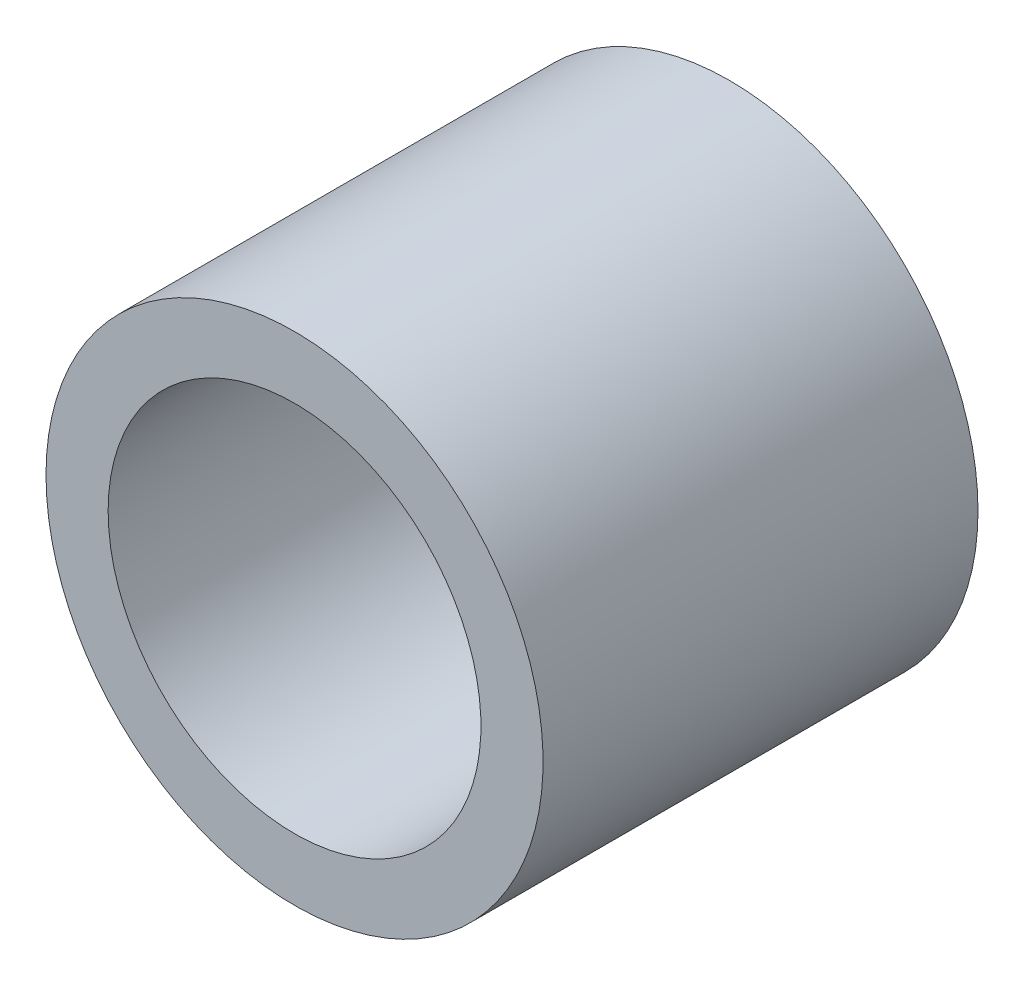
ISO-10303-21;
HEADER;
FILE_DESCRIPTION(('STEP AP214'),'2;1');
FILE_NAME('part.step','',(''),(''),'','','');
FILE_SCHEMA(('AUTOMOTIVE_DESIGN { 1 0 10303 214 1 1 1 1 }'));
ENDSEC;
DATA;
#1=APPLICATION_CONTEXT('core data for automotive mechanical design processes');
#2=APPLICATION_PROTOCOL_DEFINITION('international standard','automotive_design',2000,#1);
#3=PRODUCT_CONTEXT('',#1,'mechanical');
#4=PRODUCT('Part','Part','',(#3));
#5=PRODUCT_RELATED_PRODUCT_CATEGORY('part','',(#4));
#6=PRODUCT_DEFINITION_FORMATION('','',#4);
#7=PRODUCT_DEFINITION_CONTEXT('part definition',#1,'design');
#8=PRODUCT_DEFINITION('design','',#6,#7);
#9=PRODUCT_DEFINITION_SHAPE('','',#8);
#10=(LENGTH_UNIT() NAMED_UNIT(*) SI_UNIT(.MILLI.,.METRE.));
#11=(NAMED_UNIT(*) PLANE_ANGLE_UNIT() SI_UNIT($,.RADIAN.));
#12=(NAMED_UNIT(*) SI_UNIT($,.STERADIAN.) SOLID_ANGLE_UNIT());
#13=UNCERTAINTY_MEASURE_WITH_UNIT(LENGTH_MEASURE(1.E-05),#10,'distance_accuracy_value','');
#14=(GEOMETRIC_REPRESENTATION_CONTEXT(3) GLOBAL_UNCERTAINTY_ASSIGNED_CONTEXT((#13)) GLOBAL_UNIT_ASSIGNED_CONTEXT((#10,
#11,#12)) REPRESENTATION_CONTEXT('',''));
#15=CARTESIAN_POINT('',(0.,0.,0.));
#16=DIRECTION('',(0.,0.,1.));
#17=DIRECTION('',(1.,0.,0.));
#18=AXIS2_PLACEMENT_3D('',#15,#16,#17);
#19=CARTESIAN_POINT('',(-14.1568849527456,25.,0.));
#20=DIRECTION('',(0.,0.,1.));
#21=DIRECTION('',(1.,0.,0.));
#22=AXIS2_PLACEMENT_3D('',#19,#20,#21);
#23=PLANE('',#22);
#24=CARTESIAN_POINT('',(-14.1568849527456,25.,0.));
#25=DIRECTION('',(0.,0.,1.));
#26=DIRECTION('',(1.,0.,0.));
#27=AXIS2_PLACEMENT_3D('',#24,#25,#26);
#28=CIRCLE('',#27,4.);
#29=CARTESIAN_POINT('',(-10.1568849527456,25.,0.));
#30=VERTEX_POINT('',#29);
#31=EDGE_CURVE('E36',#30,#30,#28,.T.);
#32=ORIENTED_EDGE('',*,*,#31,.F.);
#33=EDGE_LOOP('',(#32));
#34=FACE_BOUND('',#33,.T.);
#35=CARTESIAN_POINT('',(-14.1568849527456,25.,0.));
#36=DIRECTION('',(0.,0.,1.));
#37=DIRECTION('',(1.,0.,0.));
#38=AXIS2_PLACEMENT_3D('',#35,#36,#37);
#39=CIRCLE('',#38,3.00000000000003);
#40=CARTESIAN_POINT('',(-11.1568849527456,25.,0.));
#41=VERTEX_POINT('',#40);
#42=EDGE_CURVE('E45',#41,#41,#39,.T.);
#43=ORIENTED_EDGE('',*,*,#42,.T.);
#44=EDGE_LOOP('',(#43));
#45=FACE_BOUND('',#44,.T.);
#46=ADVANCED_FACE('F29',(#34,#45),#23,.F.);
#47=CARTESIAN_POINT('',(-14.1568849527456,25.,18.3137084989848));
#48=DIRECTION('',(0.,0.,-1.));
#49=DIRECTION('',(-1.,0.,0.));
#50=AXIS2_PLACEMENT_3D('',#47,#48,#49);
#51=CYLINDRICAL_SURFACE('',#50,4.);
#52=CARTESIAN_POINT('',(-14.1568849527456,25.,7.));
#53=DIRECTION('',(0.,0.,-1.));
#54=DIRECTION('',(-1.,0.,0.));
#55=AXIS2_PLACEMENT_3D('',#52,#53,#54);
#56=CIRCLE('',#55,4.);
#57=CARTESIAN_POINT('',(-18.1568849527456,25.,7.));
#58=VERTEX_POINT('',#57);
#59=EDGE_CURVE('E40',#58,#58,#56,.T.);
#60=ORIENTED_EDGE('',*,*,#59,.T.);
#61=EDGE_LOOP('',(#60));
#62=FACE_BOUND('',#61,.T.);
#63=ORIENTED_EDGE('',*,*,#31,.T.);
#64=EDGE_LOOP('',(#63));
#65=FACE_BOUND('',#64,.T.);
#66=ADVANCED_FACE('F53',(#62,#65),#51,.T.);
#67=CARTESIAN_POINT('',(-14.1568849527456,25.,18.3137084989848));
#68=DIRECTION('',(0.,0.,-1.));
#69=DIRECTION('',(-1.,0.,0.));
#70=AXIS2_PLACEMENT_3D('',#67,#68,#69);
#71=CYLINDRICAL_SURFACE('',#70,3.00000000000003);
#72=CARTESIAN_POINT('',(-14.1568849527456,25.,7.));
#73=DIRECTION('',(0.,0.,-1.));
#74=DIRECTION('',(-1.,0.,0.));
#75=AXIS2_PLACEMENT_3D('',#72,#73,#74);
#76=CIRCLE('',#75,3.00000000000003);
#77=CARTESIAN_POINT('',(-17.1568849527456,25.,7.));
#78=VERTEX_POINT('',#77);
#79=EDGE_CURVE('E10',#78,#78,#76,.T.);
#80=ORIENTED_EDGE('',*,*,#79,.F.);
#81=EDGE_LOOP('',(#80));
#82=FACE_BOUND('',#81,.T.);
#83=ORIENTED_EDGE('',*,*,#42,.F.);
#84=EDGE_LOOP('',(#83));
#85=FACE_BOUND('',#84,.T.);
#86=ADVANCED_FACE('F51',(#82,#85),#71,.F.);
#87=CARTESIAN_POINT('',(-14.1568849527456,25.,7.));
#88=DIRECTION('',(0.,0.,-1.));
#89=DIRECTION('',(0.996756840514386,-0.0804723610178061,0.));
#90=AXIS2_PLACEMENT_3D('',#87,#88,#89);
#91=PLANE('',#90);
#92=ORIENTED_EDGE('',*,*,#79,.T.);
#93=EDGE_LOOP('',(#92));
#94=FACE_BOUND('',#93,.T.);
#95=ORIENTED_EDGE('',*,*,#59,.F.);
#96=EDGE_LOOP('',(#95));
#97=FACE_BOUND('',#96,.T.);
#98=ADVANCED_FACE('F31',(#94,#97),#91,.F.);
#99=CLOSED_SHELL('',(#46,#66,#86,#98));
#100=MANIFOLD_SOLID_BREP('B2',#99);
#101=ADVANCED_BREP_SHAPE_REPRESENTATION('',(#18,#100),#14);
#102=SHAPE_DEFINITION_REPRESENTATION(#9,#101);
ENDSEC;
END-ISO-10303-21;
